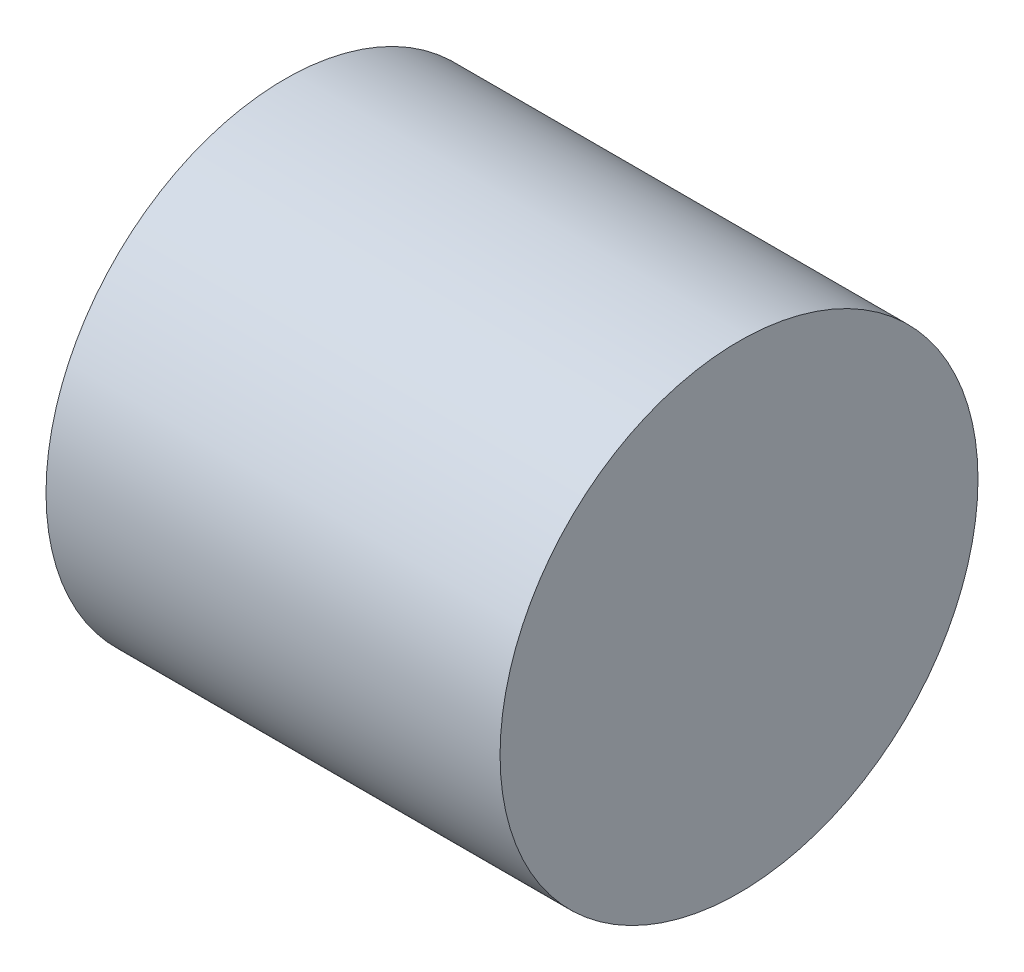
from build123d import *

# Parameters (mm, degrees)
ESQUISSE1_R      = 50
EXTRUSION1_DEPTH = 47.5


with BuildPart() as part:
    # Esquisse1 → Extrusion1 (new, symmetric)
    with BuildSketch(Plane(origin=(0, 0, 0), x_dir=(0, 0, -1), z_dir=(1, 0, 0))):
        Circle(ESQUISSE1_R)
    extrude(amount=EXTRUSION1_DEPTH, both=True)


solid = part.part
